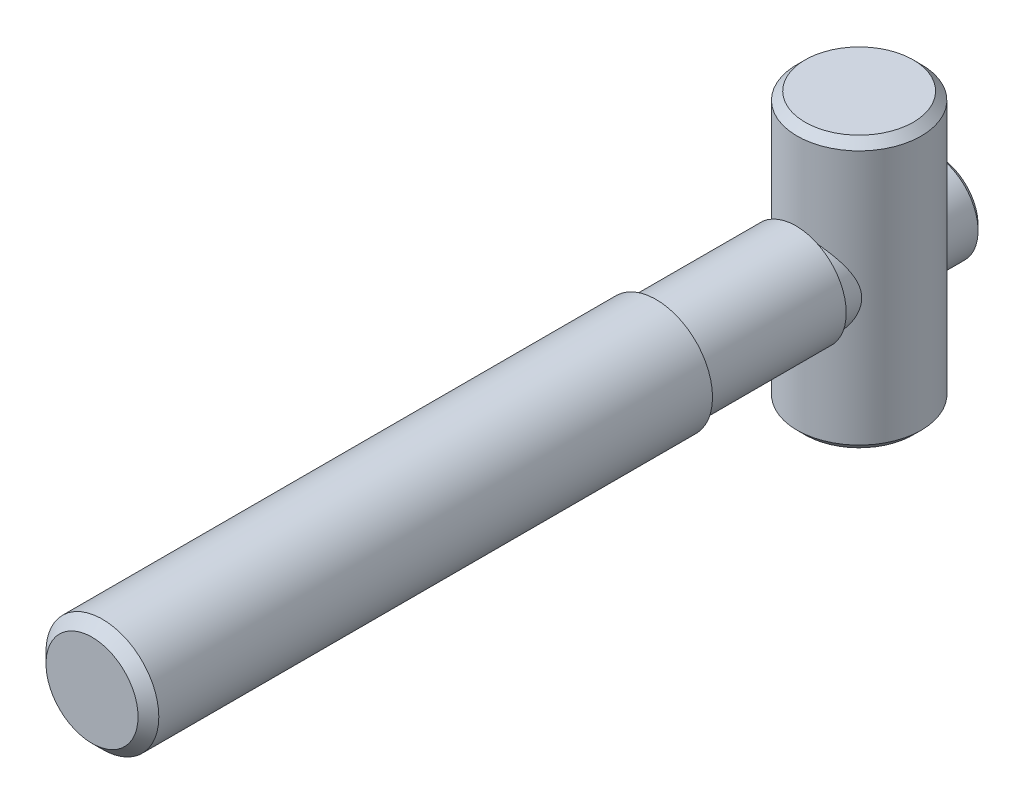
ISO-10303-21;
HEADER;
FILE_DESCRIPTION(('STEP AP214'),'2;1');
FILE_NAME('part.step','',(''),(''),'','','');
FILE_SCHEMA(('AUTOMOTIVE_DESIGN { 1 0 10303 214 1 1 1 1 }'));
ENDSEC;
DATA;
#1=APPLICATION_CONTEXT('core data for automotive mechanical design processes');
#2=APPLICATION_PROTOCOL_DEFINITION('international standard','automotive_design',2000,#1);
#3=PRODUCT_CONTEXT('',#1,'mechanical');
#4=PRODUCT('Part','Part','',(#3));
#5=PRODUCT_RELATED_PRODUCT_CATEGORY('part','',(#4));
#6=PRODUCT_DEFINITION_FORMATION('','',#4);
#7=PRODUCT_DEFINITION_CONTEXT('part definition',#1,'design');
#8=PRODUCT_DEFINITION('design','',#6,#7);
#9=PRODUCT_DEFINITION_SHAPE('','',#8);
#10=(LENGTH_UNIT() NAMED_UNIT(*) SI_UNIT(.MILLI.,.METRE.));
#11=(NAMED_UNIT(*) PLANE_ANGLE_UNIT() SI_UNIT($,.RADIAN.));
#12=(NAMED_UNIT(*) SI_UNIT($,.STERADIAN.) SOLID_ANGLE_UNIT());
#13=UNCERTAINTY_MEASURE_WITH_UNIT(LENGTH_MEASURE(1.E-05),#10,'distance_accuracy_value','');
#14=(GEOMETRIC_REPRESENTATION_CONTEXT(3) GLOBAL_UNCERTAINTY_ASSIGNED_CONTEXT((#13)) GLOBAL_UNIT_ASSIGNED_CONTEXT((#10,
#11,#12)) REPRESENTATION_CONTEXT('',''));
#15=CARTESIAN_POINT('',(0.,0.,0.));
#16=DIRECTION('',(0.,0.,1.));
#17=DIRECTION('',(1.,0.,0.));
#18=AXIS2_PLACEMENT_3D('',#15,#16,#17);
#19=CARTESIAN_POINT('',(0.,-12.,-18.3));
#20=DIRECTION('',(0.,-1.,0.));
#21=DIRECTION('',(-1.,0.,0.));
#22=AXIS2_PLACEMENT_3D('',#19,#20,#21);
#23=PLANE('',#22);
#24=CARTESIAN_POINT('',(0.,-12.,-18.3));
#25=DIRECTION('',(0.,-1.,0.));
#26=DIRECTION('',(-1.,0.,0.));
#27=AXIS2_PLACEMENT_3D('',#24,#25,#26);
#28=CIRCLE('',#27,4.79289321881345);
#29=CARTESIAN_POINT('',(-4.79289321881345,-12.,-18.3));
#30=VERTEX_POINT('',#29);
#31=EDGE_CURVE('E145',#30,#30,#28,.T.);
#32=ORIENTED_EDGE('',*,*,#31,.T.);
#33=EDGE_LOOP('',(#32));
#34=FACE_BOUND('',#33,.T.);
#35=ADVANCED_FACE('F14',(#34),#23,.T.);
#36=CARTESIAN_POINT('',(0.,12.,-18.3));
#37=DIRECTION('',(0.,1.,0.));
#38=DIRECTION('',(1.,0.,0.));
#39=AXIS2_PLACEMENT_3D('',#36,#37,#38);
#40=PLANE('',#39);
#41=CARTESIAN_POINT('',(0.,12.,-18.3));
#42=DIRECTION('',(0.,1.,0.));
#43=DIRECTION('',(1.,0.,0.));
#44=AXIS2_PLACEMENT_3D('',#41,#42,#43);
#45=CIRCLE('',#44,4.79289321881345);
#46=CARTESIAN_POINT('',(4.79289321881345,12.,-18.3));
#47=VERTEX_POINT('',#46);
#48=EDGE_CURVE('E9',#47,#47,#45,.T.);
#49=ORIENTED_EDGE('',*,*,#48,.T.);
#50=EDGE_LOOP('',(#49));
#51=FACE_BOUND('',#50,.T.);
#52=ADVANCED_FACE('F181',(#51),#40,.T.);
#53=CARTESIAN_POINT('',(0.,-12.,-18.3));
#54=DIRECTION('',(0.,1.,0.));
#55=DIRECTION('',(1.,0.,0.));
#56=AXIS2_PLACEMENT_3D('',#53,#54,#55);
#57=CONICAL_SURFACE('',#56,4.79289321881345,0.785398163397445);
#58=CARTESIAN_POINT('',(0.,-11.2928932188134,-18.3));
#59=DIRECTION('',(0.,-1.,0.));
#60=DIRECTION('',(-1.,0.,0.));
#61=AXIS2_PLACEMENT_3D('',#58,#59,#60);
#62=CIRCLE('',#61,5.5);
#63=CARTESIAN_POINT('',(-5.5,-11.2928932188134,-18.3));
#64=VERTEX_POINT('',#63);
#65=EDGE_CURVE('E23',#64,#64,#62,.F.);
#66=ORIENTED_EDGE('',*,*,#65,.F.);
#67=EDGE_LOOP('',(#66));
#68=FACE_BOUND('',#67,.T.);
#69=ORIENTED_EDGE('',*,*,#31,.F.);
#70=EDGE_LOOP('',(#69));
#71=FACE_BOUND('',#70,.T.);
#72=ADVANCED_FACE('F183',(#68,#71),#57,.T.);
#73=CARTESIAN_POINT('',(0.,12.,-18.3));
#74=DIRECTION('',(0.,-1.,0.));
#75=DIRECTION('',(-1.,0.,0.));
#76=AXIS2_PLACEMENT_3D('',#73,#74,#75);
#77=CONICAL_SURFACE('',#76,4.79289321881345,0.785398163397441);
#78=CARTESIAN_POINT('',(0.,11.2928932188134,-18.3));
#79=DIRECTION('',(0.,1.,0.));
#80=DIRECTION('',(1.,0.,0.));
#81=AXIS2_PLACEMENT_3D('',#78,#79,#80);
#82=CIRCLE('',#81,5.5);
#83=CARTESIAN_POINT('',(5.5,11.2928932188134,-18.3));
#84=VERTEX_POINT('',#83);
#85=EDGE_CURVE('E149',#84,#84,#82,.F.);
#86=ORIENTED_EDGE('',*,*,#85,.F.);
#87=EDGE_LOOP('',(#86));
#88=FACE_BOUND('',#87,.T.);
#89=ORIENTED_EDGE('',*,*,#48,.F.);
#90=EDGE_LOOP('',(#89));
#91=FACE_BOUND('',#90,.T.);
#92=ADVANCED_FACE('F174',(#88,#91),#77,.T.);
#93=CARTESIAN_POINT('',(0.,12.,-18.3));
#94=DIRECTION('',(0.,1.,0.));
#95=DIRECTION('',(1.,0.,0.));
#96=AXIS2_PLACEMENT_3D('',#93,#94,#95);
#97=CYLINDRICAL_SURFACE('',#96,5.5);
#98=DIRECTION('',(0.,1.,0.));
#99=VECTOR('',#98,1.);
#100=CARTESIAN_POINT('',(0.6,12.,-23.7671747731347));
#101=LINE('',#100,#99);
#102=CARTESIAN_POINT('',(0.6,-3.95474398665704,-23.7671747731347));
#103=VERTEX_POINT('',#102);
#104=CARTESIAN_POINT('',(0.6,3.95474398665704,-23.7671747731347));
#105=VERTEX_POINT('',#104);
#106=EDGE_CURVE('E81',#103,#105,#101,.T.);
#107=ORIENTED_EDGE('',*,*,#106,.F.);
#108=CARTESIAN_POINT('',(4.,0.,-22.0749172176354));
#109=CARTESIAN_POINT('',(3.99999971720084,0.094559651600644,-22.0749177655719));
#110=CARTESIAN_POINT('',(3.99663873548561,0.189122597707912,-22.078488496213));
#111=CARTESIAN_POINT('',(3.98328406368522,0.377297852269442,-22.0925637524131));
#112=CARTESIAN_POINT('',(3.97328671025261,0.470909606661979,-22.1030721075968));
#113=CARTESIAN_POINT('',(3.94687649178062,0.65648336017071,-22.1304732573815));
#114=CARTESIAN_POINT('',(3.93044906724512,0.748441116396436,-22.1473805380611));
#115=CARTESIAN_POINT('',(3.89152450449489,0.929870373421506,-22.1867470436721));
#116=CARTESIAN_POINT('',(3.86902376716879,1.01934036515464,-22.2092095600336));
#117=CARTESIAN_POINT('',(3.79365509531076,1.28093397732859,-22.2828450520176));
#118=CARTESIAN_POINT('',(3.73252985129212,1.44885844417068,-22.3407009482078));
#119=CARTESIAN_POINT('',(3.590688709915,1.77146295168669,-22.4672506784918));
#120=CARTESIAN_POINT('',(3.50997431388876,1.92614400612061,-22.5359436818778));
#121=CARTESIAN_POINT('',(3.31318173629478,2.25065582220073,-22.6922095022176));
#122=CARTESIAN_POINT('',(3.19328494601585,2.41764951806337,-22.7808675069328));
#123=CARTESIAN_POINT('',(2.92908108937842,2.73178094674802,-22.9578760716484));
#124=CARTESIAN_POINT('',(2.78474090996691,2.87889125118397,-23.0462260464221));
#125=CARTESIAN_POINT('',(2.5362822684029,3.09553636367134,-23.1814353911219));
#126=CARTESIAN_POINT('',(2.43963284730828,3.17231415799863,-23.2305740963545));
#127=CARTESIAN_POINT('',(2.23844845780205,3.31733570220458,-23.3251054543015));
#128=CARTESIAN_POINT('',(2.13391712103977,3.38558334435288,-23.3704998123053));
#129=CARTESIAN_POINT('',(1.91752007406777,3.51266692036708,-23.4562228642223));
#130=CARTESIAN_POINT('',(1.80566515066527,3.57151627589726,-23.49655876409));
#131=CARTESIAN_POINT('',(1.57523382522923,3.67896799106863,-23.5709873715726));
#132=CARTESIAN_POINT('',(1.45666071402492,3.72757531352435,-23.6050831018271));
#133=CARTESIAN_POINT('',(1.16188171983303,3.83193503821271,-23.678830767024));
#134=CARTESIAN_POINT('',(0.982606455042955,3.88193864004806,-23.7146815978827));
#135=CARTESIAN_POINT('',(0.616370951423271,3.95663720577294,-23.7684829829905));
#136=CARTESIAN_POINT('',(0.429417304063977,3.98135342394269,-23.7864485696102));
#137=CARTESIAN_POINT('',(0.052567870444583,4.00411402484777,-23.8029868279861));
#138=CARTESIAN_POINT('',(-0.137333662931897,4.00209732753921,-23.8015150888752));
#139=CARTESIAN_POINT('',(-0.51380986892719,3.97135939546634,-23.7791958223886));
#140=CARTESIAN_POINT('',(-0.700383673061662,3.94263129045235,-23.7583433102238));
#141=CARTESIAN_POINT('',(-1.05962164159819,3.86136821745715,-23.699944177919));
#142=CARTESIAN_POINT('',(-1.23253206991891,3.80954610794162,-23.6628980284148));
#143=CARTESIAN_POINT('',(-1.56671343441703,3.68473335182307,-23.5749694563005));
#144=CARTESIAN_POINT('',(-1.72798199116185,3.61173839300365,-23.5240842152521));
#145=CARTESIAN_POINT('',(-2.05370310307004,3.43803005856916,-23.4054456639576));
#146=CARTESIAN_POINT('',(-2.2165364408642,3.33514439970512,-23.3364494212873));
#147=CARTESIAN_POINT('',(-2.52348319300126,3.10940476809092,-23.189889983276));
#148=CARTESIAN_POINT('',(-2.66757825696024,2.98653148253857,-23.1123185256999));
#149=CARTESIAN_POINT('',(-2.96150593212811,2.69807007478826,-22.9383041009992));
#150=CARTESIAN_POINT('',(-3.10726104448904,2.52879913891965,-22.8410685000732));
#151=CARTESIAN_POINT('',(-3.36953999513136,2.16705523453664,-22.6499971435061));
#152=CARTESIAN_POINT('',(-3.48605965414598,1.97457895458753,-22.556161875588));
#153=CARTESIAN_POINT('',(-3.66526169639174,1.61165125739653,-22.402032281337));
#154=CARTESIAN_POINT('',(-3.73414032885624,1.44549066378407,-22.3388789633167));
#155=CARTESIAN_POINT('',(-3.84985589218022,1.10068331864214,-22.2287430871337));
#156=CARTESIAN_POINT('',(-3.89674227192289,0.922065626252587,-22.1817243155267));
#157=CARTESIAN_POINT('',(-3.9599937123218,0.585461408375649,-22.1170906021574));
#158=CARTESIAN_POINT('',(-3.98009730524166,0.428880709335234,-22.0959235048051));
#159=CARTESIAN_POINT('',(-4.00152507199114,0.113064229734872,-22.0733369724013));
#160=CARTESIAN_POINT('',(-4.00286519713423,-0.0461691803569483,-22.0719007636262));
#161=CARTESIAN_POINT('',(-3.98669865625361,-0.362327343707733,-22.0889767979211));
#162=CARTESIAN_POINT('',(-3.96921589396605,-0.519254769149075,-22.1074637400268));
#163=CARTESIAN_POINT('',(-3.91666535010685,-0.82717652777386,-22.1614916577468));
#164=CARTESIAN_POINT('',(-3.88157034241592,-0.978161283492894,-22.1970590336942));
#165=CARTESIAN_POINT('',(-3.77812999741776,-1.33113055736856,-22.2978469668));
#166=CARTESIAN_POINT('',(-3.70207893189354,-1.52906623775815,-22.3692423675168));
#167=CARTESIAN_POINT('',(-3.52270580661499,-1.90640842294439,-22.5254840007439));
#168=CARTESIAN_POINT('',(-3.41932922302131,-2.08577687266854,-22.6103569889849));
#169=CARTESIAN_POINT('',(-3.18411833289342,-2.43025180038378,-22.7870574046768));
#170=CARTESIAN_POINT('',(-3.05152555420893,-2.59477148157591,-22.8790168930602));
#171=CARTESIAN_POINT('',(-2.76125147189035,-2.90173861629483,-23.059699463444));
#172=CARTESIAN_POINT('',(-2.6035911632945,-3.04420434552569,-23.1484251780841));
#173=CARTESIAN_POINT('',(-2.271539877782,-3.2987599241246,-23.3122631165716));
#174=CARTESIAN_POINT('',(-2.09818660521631,-3.41190835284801,-23.3878018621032));
#175=CARTESIAN_POINT('',(-1.82330793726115,-3.56180731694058,-23.4899086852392));
#176=CARTESIAN_POINT('',(-1.72916099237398,-3.6084863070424,-23.5220894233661));
#177=CARTESIAN_POINT('',(-1.53632285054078,-3.69470582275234,-23.5820343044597));
#178=CARTESIAN_POINT('',(-1.43763386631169,-3.73424977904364,-23.6098005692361));
#179=CARTESIAN_POINT('',(-1.23534308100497,-3.80598862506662,-23.6604944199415));
#180=CARTESIAN_POINT('',(-1.13170490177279,-3.83811376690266,-23.683375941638));
#181=CARTESIAN_POINT('',(-0.921160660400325,-3.89401032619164,-23.7233693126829));
#182=CARTESIAN_POINT('',(-0.81425636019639,-3.9177861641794,-23.7404842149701));
#183=CARTESIAN_POINT('',(-0.598125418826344,-3.95655048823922,-23.7684652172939));
#184=CARTESIAN_POINT('',(-0.488900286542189,-3.9715445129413,-23.7793352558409));
#185=CARTESIAN_POINT('',(-0.269138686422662,-3.9924605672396,-23.7945144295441));
#186=CARTESIAN_POINT('',(-0.15860243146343,-3.99838404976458,-23.7988246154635));
#187=CARTESIAN_POINT('',(0.0467313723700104,-4.00084937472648,-23.8006178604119));
#188=CARTESIAN_POINT('',(0.141509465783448,-3.99861635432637,-23.7989924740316));
#189=CARTESIAN_POINT('',(0.330490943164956,-3.98744748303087,-23.7908762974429));
#190=CARTESIAN_POINT('',(0.424694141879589,-3.97850957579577,-23.7843840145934));
#191=CARTESIAN_POINT('',(0.611759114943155,-3.95406659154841,-23.7666782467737));
#192=CARTESIAN_POINT('',(0.704621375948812,-3.93856396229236,-23.7554665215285));
#193=CARTESIAN_POINT('',(0.88841574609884,-3.90122128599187,-23.7285691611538));
#194=CARTESIAN_POINT('',(0.979347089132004,-3.87937877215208,-23.7128817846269));
#195=CARTESIAN_POINT('',(1.24445933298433,-3.80583624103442,-23.6603363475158));
#196=CARTESIAN_POINT('',(1.41518501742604,-3.74554675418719,-23.6175701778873));
#197=CARTESIAN_POINT('',(1.74369677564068,-3.60438289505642,-23.5191022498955));
#198=CARTESIAN_POINT('',(1.90148075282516,-3.5235051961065,-23.4633984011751));
#199=CARTESIAN_POINT('',(2.22228203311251,-3.33179335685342,-23.3343972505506));
#200=CARTESIAN_POINT('',(2.38322541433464,-3.21841054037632,-23.2597469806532));
#201=CARTESIAN_POINT('',(2.68497920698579,-2.97136345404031,-23.103106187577));
#202=CARTESIAN_POINT('',(2.82576198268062,-2.8376718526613,-23.0211058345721));
#203=CARTESIAN_POINT('',(3.03332548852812,-2.61000808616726,-22.8888332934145));
#204=CARTESIAN_POINT('',(3.10699576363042,-2.5218601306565,-22.839152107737));
#205=CARTESIAN_POINT('',(3.24665706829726,-2.3393224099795,-22.7403298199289));
#206=CARTESIAN_POINT('',(3.31264615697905,-2.24493107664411,-22.69118885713));
#207=CARTESIAN_POINT('',(3.43660180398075,-2.0501419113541,-22.5948719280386));
#208=CARTESIAN_POINT('',(3.49457298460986,-1.94974758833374,-22.5476948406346));
#209=CARTESIAN_POINT('',(3.6021255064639,-1.74306577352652,-22.4568795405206));
#210=CARTESIAN_POINT('',(3.6517073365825,-1.63677862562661,-22.4132411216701));
#211=CARTESIAN_POINT('',(3.76078752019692,-1.37275858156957,-22.3142162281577));
#212=CARTESIAN_POINT('',(3.81580236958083,-1.21205137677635,-22.2615166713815));
#213=CARTESIAN_POINT('',(3.88309107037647,-0.963817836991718,-22.1952018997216));
#214=CARTESIAN_POINT('',(3.90296834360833,-0.879972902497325,-22.1752342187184));
#215=CARTESIAN_POINT('',(3.93739985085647,-0.710192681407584,-22.1402454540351));
#216=CARTESIAN_POINT('',(3.95195647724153,-0.62425835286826,-22.1252221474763));
#217=CARTESIAN_POINT('',(3.97571410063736,-0.449073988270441,-22.1005263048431));
#218=CARTESIAN_POINT('',(3.98480070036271,-0.359792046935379,-22.0909682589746));
#219=CARTESIAN_POINT('',(3.99694447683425,-0.180341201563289,-22.0781627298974));
#220=CARTESIAN_POINT('',(4.00000026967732,-0.0901720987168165,-22.0749166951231));
#221=CARTESIAN_POINT('',(4.,0.,-22.0749172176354));
#222=B_SPLINE_CURVE_WITH_KNOTS('',3,(#108,#109,#110,#111,#112,#113,#114,#115,#116,#117,#118,
#119,#120,#121,#122,#123,#124,#125,#126,#127,#128,#129,#130,#131,#132,#133,#134,#135,#136,#137,
#138,#139,#140,#141,#142,#143,#144,#145,#146,#147,#148,#149,#150,#151,#152,#153,#154,#155,#156,
#157,#158,#159,#160,#161,#162,#163,#164,#165,#166,#167,#168,#169,#170,#171,#172,#173,#174,#175,
#176,#177,#178,#179,#180,#181,#182,#183,#184,#185,#186,#187,#188,#189,#190,#191,#192,#193,#194,
#195,#196,#197,#198,#199,#200,#201,#202,#203,#204,#205,#206,#207,#208,#209,#210,#211,#212,#213,
#214,#215,#216,#217,#218,#219,#220,#221),.UNSPECIFIED.,.T.,.F.,(4,2,2,2,2,2,2,2,2,2,2,2,2,2,2,2,
2,2,2,2,2,2,2,2,2,2,2,2,2,2,2,2,2,2,2,2,2,2,2,2,2,2,2,2,2,2,2,2,2,2,2,2,2,2,2,2,4),(0.,
0.283560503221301,0.567277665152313,0.851640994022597,1.13617321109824,1.69729774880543,
2.25837929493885,2.92774006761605,3.59801497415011,3.99610080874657,4.39400433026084,
4.79133442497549,5.18847154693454,5.75445889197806,6.31997012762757,6.88677367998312,
7.45372305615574,8.00426875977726,8.5549266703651,9.16646484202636,9.77859745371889,
10.5066073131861,11.2347211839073,11.8047550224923,12.3735009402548,12.8491941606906,
13.3244829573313,13.7991688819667,14.2745908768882,14.94214771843,15.6110467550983,
16.2999460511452,16.9882713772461,17.6463931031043,17.9757519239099,18.3049519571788,
18.6371312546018,18.9691344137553,19.3009279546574,19.6326683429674,19.9167672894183,
20.2009534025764,20.4850336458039,20.7692245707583,21.3249022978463,21.8806698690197,
22.5100347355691,23.1402542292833,23.5154020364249,23.8906444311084,24.2656695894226,
24.6406728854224,25.1720162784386,25.4371121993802,25.7020887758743,25.9724300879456,
26.24283342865),.UNSPECIFIED.);
#223=EDGE_CURVE('E76',#103,#105,#222,.T.);
#224=ORIENTED_EDGE('',*,*,#223,.T.);
#225=EDGE_LOOP('',(#107,#224));
#226=FACE_BOUND('',#225,.T.);
#227=ORIENTED_EDGE('',*,*,#85,.T.);
#228=EDGE_LOOP('',(#227));
#229=FACE_BOUND('',#228,.T.);
#230=ORIENTED_EDGE('',*,*,#65,.T.);
#231=EDGE_LOOP('',(#230));
#232=FACE_BOUND('',#231,.T.);
#233=CARTESIAN_POINT('',(4.,0.,-14.5250827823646));
#234=CARTESIAN_POINT('',(3.99999971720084,-0.0945596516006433,-14.5250822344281));
#235=CARTESIAN_POINT('',(3.99663873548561,-0.189122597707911,-14.521511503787));
#236=CARTESIAN_POINT('',(3.98328406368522,-0.37729785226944,-14.5074362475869));
#237=CARTESIAN_POINT('',(3.97328671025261,-0.470909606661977,-14.4969278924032));
#238=CARTESIAN_POINT('',(3.94687649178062,-0.65648336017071,-14.4695267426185));
#239=CARTESIAN_POINT('',(3.93044906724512,-0.748441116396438,-14.4526194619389));
#240=CARTESIAN_POINT('',(3.89152450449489,-0.929870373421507,-14.4132529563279));
#241=CARTESIAN_POINT('',(3.86902376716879,-1.01934036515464,-14.3907904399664));
#242=CARTESIAN_POINT('',(3.79365509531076,-1.28093397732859,-14.3171549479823));
#243=CARTESIAN_POINT('',(3.73252985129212,-1.44885844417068,-14.2592990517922));
#244=CARTESIAN_POINT('',(3.590688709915,-1.7714629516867,-14.1327493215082));
#245=CARTESIAN_POINT('',(3.50997431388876,-1.92614400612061,-14.0640563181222));
#246=CARTESIAN_POINT('',(3.31318173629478,-2.25065582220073,-13.9077904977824));
#247=CARTESIAN_POINT('',(3.19328494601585,-2.41764951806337,-13.8191324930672));
#248=CARTESIAN_POINT('',(2.92908108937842,-2.73178094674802,-13.6421239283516));
#249=CARTESIAN_POINT('',(2.78474090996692,-2.87889125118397,-13.5537739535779));
#250=CARTESIAN_POINT('',(2.53628226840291,-3.09553636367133,-13.4185646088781));
#251=CARTESIAN_POINT('',(2.43963284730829,-3.17231415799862,-13.3694259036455));
#252=CARTESIAN_POINT('',(2.23844845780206,-3.31733570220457,-13.2748945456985));
#253=CARTESIAN_POINT('',(2.13391712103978,-3.38558334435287,-13.2295001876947));
#254=CARTESIAN_POINT('',(1.91752007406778,-3.51266692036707,-13.1437771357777));
#255=CARTESIAN_POINT('',(1.80566515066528,-3.57151627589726,-13.10344123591));
#256=CARTESIAN_POINT('',(1.57523382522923,-3.67896799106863,-13.0290126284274));
#257=CARTESIAN_POINT('',(1.45666071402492,-3.72757531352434,-12.9949168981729));
#258=CARTESIAN_POINT('',(1.16188171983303,-3.83193503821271,-12.921169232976));
#259=CARTESIAN_POINT('',(0.982606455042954,-3.88193864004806,-12.8853184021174));
#260=CARTESIAN_POINT('',(0.616370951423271,-3.95663720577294,-12.8315170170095));
#261=CARTESIAN_POINT('',(0.429417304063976,-3.98135342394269,-12.8135514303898));
#262=CARTESIAN_POINT('',(0.0525678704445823,-4.00411402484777,-12.7970131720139));
#263=CARTESIAN_POINT('',(-0.137333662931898,-4.00209732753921,-12.7984849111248));
#264=CARTESIAN_POINT('',(-0.51380986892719,-3.97135939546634,-12.8208041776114));
#265=CARTESIAN_POINT('',(-0.700383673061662,-3.94263129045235,-12.8416566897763));
#266=CARTESIAN_POINT('',(-1.05962164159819,-3.86136821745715,-12.900055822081));
#267=CARTESIAN_POINT('',(-1.23253206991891,-3.80954610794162,-12.9371019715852));
#268=CARTESIAN_POINT('',(-1.56671343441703,-3.68473335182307,-13.0250305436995));
#269=CARTESIAN_POINT('',(-1.72798199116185,-3.61173839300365,-13.0759157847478));
#270=CARTESIAN_POINT('',(-2.05370310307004,-3.43803005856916,-13.1945543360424));
#271=CARTESIAN_POINT('',(-2.2165364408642,-3.33514439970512,-13.2635505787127));
#272=CARTESIAN_POINT('',(-2.52348319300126,-3.10940476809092,-13.410110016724));
#273=CARTESIAN_POINT('',(-2.66757825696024,-2.98653148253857,-13.4876814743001));
#274=CARTESIAN_POINT('',(-2.96150593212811,-2.69807007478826,-13.6616958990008));
#275=CARTESIAN_POINT('',(-3.10726104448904,-2.52879913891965,-13.7589314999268));
#276=CARTESIAN_POINT('',(-3.36953999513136,-2.16705523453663,-13.9500028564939));
#277=CARTESIAN_POINT('',(-3.48605965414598,-1.97457895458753,-14.043838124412));
#278=CARTESIAN_POINT('',(-3.66526169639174,-1.61165125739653,-14.197967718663));
#279=CARTESIAN_POINT('',(-3.73414032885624,-1.44549066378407,-14.2611210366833));
#280=CARTESIAN_POINT('',(-3.84985589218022,-1.10068331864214,-14.3712569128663));
#281=CARTESIAN_POINT('',(-3.8967422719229,-0.922065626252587,-14.4182756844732));
#282=CARTESIAN_POINT('',(-3.95999371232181,-0.585461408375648,-14.4829093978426));
#283=CARTESIAN_POINT('',(-3.98009730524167,-0.428880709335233,-14.5040764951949));
#284=CARTESIAN_POINT('',(-4.00152507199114,-0.113064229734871,-14.5266630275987));
#285=CARTESIAN_POINT('',(-4.00286519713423,0.0461691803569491,-14.5280992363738));
#286=CARTESIAN_POINT('',(-3.98669865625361,0.362327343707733,-14.5110232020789));
#287=CARTESIAN_POINT('',(-3.96921589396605,0.519254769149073,-14.4925362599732));
#288=CARTESIAN_POINT('',(-3.91666535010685,0.827176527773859,-14.4385083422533));
#289=CARTESIAN_POINT('',(-3.88157034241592,0.978161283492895,-14.4029409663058));
#290=CARTESIAN_POINT('',(-3.77812999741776,1.33113055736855,-14.3021530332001));
#291=CARTESIAN_POINT('',(-3.70207893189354,1.52906623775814,-14.2307576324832));
#292=CARTESIAN_POINT('',(-3.522705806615,1.90640842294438,-14.0745159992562));
#293=CARTESIAN_POINT('',(-3.41932922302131,2.08577687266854,-13.9896430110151));
#294=CARTESIAN_POINT('',(-3.18411833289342,2.43025180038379,-13.8129425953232));
#295=CARTESIAN_POINT('',(-3.05152555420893,2.59477148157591,-13.7209831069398));
#296=CARTESIAN_POINT('',(-2.76125147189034,2.90173861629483,-13.540300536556));
#297=CARTESIAN_POINT('',(-2.6035911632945,3.04420434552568,-13.4515748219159));
#298=CARTESIAN_POINT('',(-2.271539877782,3.2987599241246,-13.2877368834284));
#299=CARTESIAN_POINT('',(-2.09818660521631,3.41190835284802,-13.2121981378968));
#300=CARTESIAN_POINT('',(-1.82330793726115,3.56180731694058,-13.1100913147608));
#301=CARTESIAN_POINT('',(-1.72916099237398,3.6084863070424,-13.0779105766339));
#302=CARTESIAN_POINT('',(-1.53632285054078,3.69470582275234,-13.0179656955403));
#303=CARTESIAN_POINT('',(-1.43763386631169,3.73424977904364,-12.990199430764));
#304=CARTESIAN_POINT('',(-1.23534308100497,3.80598862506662,-12.9395055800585));
#305=CARTESIAN_POINT('',(-1.13170490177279,3.83811376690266,-12.916624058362));
#306=CARTESIAN_POINT('',(-0.921160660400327,3.89401032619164,-12.8766306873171));
#307=CARTESIAN_POINT('',(-0.814256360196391,3.9177861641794,-12.8595157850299));
#308=CARTESIAN_POINT('',(-0.598125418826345,3.95655048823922,-12.8315347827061));
#309=CARTESIAN_POINT('',(-0.488900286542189,3.9715445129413,-12.8206647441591));
#310=CARTESIAN_POINT('',(-0.269138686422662,3.9924605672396,-12.8054855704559));
#311=CARTESIAN_POINT('',(-0.158602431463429,3.99838404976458,-12.8011753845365));
#312=CARTESIAN_POINT('',(0.046731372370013,4.00084937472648,-12.7993821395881));
#313=CARTESIAN_POINT('',(0.141509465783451,3.99861635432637,-12.8010075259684));
#314=CARTESIAN_POINT('',(0.330490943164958,3.98744748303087,-12.8091237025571));
#315=CARTESIAN_POINT('',(0.424694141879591,3.97850957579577,-12.8156159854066));
#316=CARTESIAN_POINT('',(0.611759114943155,3.95406659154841,-12.8333217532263));
#317=CARTESIAN_POINT('',(0.704621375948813,3.93856396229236,-12.8445334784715));
#318=CARTESIAN_POINT('',(0.88841574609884,3.90122128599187,-12.8714308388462));
#319=CARTESIAN_POINT('',(0.979347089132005,3.87937877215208,-12.8871182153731));
#320=CARTESIAN_POINT('',(1.24445933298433,3.80583624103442,-12.9396636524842));
#321=CARTESIAN_POINT('',(1.41518501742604,3.74554675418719,-12.9824298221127));
#322=CARTESIAN_POINT('',(1.74369677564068,3.60438289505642,-13.0808977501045));
#323=CARTESIAN_POINT('',(1.90148075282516,3.5235051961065,-13.1366015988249));
#324=CARTESIAN_POINT('',(2.22228203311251,3.33179335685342,-13.2656027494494));
#325=CARTESIAN_POINT('',(2.38322541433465,3.21841054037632,-13.3402530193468));
#326=CARTESIAN_POINT('',(2.68497920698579,2.97136345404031,-13.496893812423));
#327=CARTESIAN_POINT('',(2.82576198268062,2.8376718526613,-13.5788941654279));
#328=CARTESIAN_POINT('',(3.03332548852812,2.61000808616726,-13.7111667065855));
#329=CARTESIAN_POINT('',(3.10699576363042,2.5218601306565,-13.760847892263));
#330=CARTESIAN_POINT('',(3.24665706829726,2.33932240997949,-13.8596701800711));
#331=CARTESIAN_POINT('',(3.31264615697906,2.24493107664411,-13.9088111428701));
#332=CARTESIAN_POINT('',(3.43660180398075,2.05014191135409,-14.0051280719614));
#333=CARTESIAN_POINT('',(3.49457298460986,1.94974758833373,-14.0523051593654));
#334=CARTESIAN_POINT('',(3.60212550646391,1.74306577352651,-14.1431204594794));
#335=CARTESIAN_POINT('',(3.65170733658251,1.6367786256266,-14.18675887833));
#336=CARTESIAN_POINT('',(3.76078752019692,1.37275858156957,-14.2857837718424));
#337=CARTESIAN_POINT('',(3.81580236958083,1.21205137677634,-14.3384833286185));
#338=CARTESIAN_POINT('',(3.88309107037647,0.963817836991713,-14.4047981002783));
#339=CARTESIAN_POINT('',(3.90296834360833,0.879972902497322,-14.4247657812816));
#340=CARTESIAN_POINT('',(3.93739985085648,0.71019268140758,-14.4597545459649));
#341=CARTESIAN_POINT('',(3.95195647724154,0.624258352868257,-14.4747778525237));
#342=CARTESIAN_POINT('',(3.97571410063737,0.449073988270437,-14.4994736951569));
#343=CARTESIAN_POINT('',(3.98480070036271,0.359792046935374,-14.5090317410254));
#344=CARTESIAN_POINT('',(3.99694447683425,0.180341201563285,-14.5218372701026));
#345=CARTESIAN_POINT('',(4.00000026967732,0.0901720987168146,-14.525083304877));
#346=CARTESIAN_POINT('',(4.,0.,-14.5250827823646));
#347=B_SPLINE_CURVE_WITH_KNOTS('',3,(#233,#234,#235,#236,#237,#238,#239,#240,#241,#242,#243,
#244,#245,#246,#247,#248,#249,#250,#251,#252,#253,#254,#255,#256,#257,#258,#259,#260,#261,#262,
#263,#264,#265,#266,#267,#268,#269,#270,#271,#272,#273,#274,#275,#276,#277,#278,#279,#280,#281,
#282,#283,#284,#285,#286,#287,#288,#289,#290,#291,#292,#293,#294,#295,#296,#297,#298,#299,#300,
#301,#302,#303,#304,#305,#306,#307,#308,#309,#310,#311,#312,#313,#314,#315,#316,#317,#318,#319,
#320,#321,#322,#323,#324,#325,#326,#327,#328,#329,#330,#331,#332,#333,#334,#335,#336,#337,#338,
#339,#340,#341,#342,#343,#344,#345,#346),.UNSPECIFIED.,.T.,.F.,(4,2,2,2,2,2,2,2,2,2,2,2,2,2,2,2,
2,2,2,2,2,2,2,2,2,2,2,2,2,2,2,2,2,2,2,2,2,2,2,2,2,2,2,2,2,2,2,2,2,2,2,2,2,2,2,2,4),(0.,
0.2835605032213,0.567277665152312,0.851640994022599,1.13617321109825,1.69729774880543,
2.25837929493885,2.92774006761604,3.59801497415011,3.99610080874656,4.39400433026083,
4.79133442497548,5.18847154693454,5.75445889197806,6.31997012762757,6.88677367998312,
7.45372305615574,8.00426875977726,8.5549266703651,9.16646484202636,9.77859745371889,
10.5066073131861,11.2347211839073,11.8047550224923,12.3735009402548,12.8491941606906,
13.3244829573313,13.7991688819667,14.2745908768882,14.94214771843,15.6110467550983,
16.2999460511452,16.9882713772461,17.6463931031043,17.9757519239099,18.3049519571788,
18.6371312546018,18.9691344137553,19.3009279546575,19.6326683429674,19.9167672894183,
20.2009534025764,20.4850336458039,20.7692245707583,21.3249022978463,21.8806698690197,
22.5100347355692,23.1402542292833,23.5154020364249,23.8906444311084,24.2656695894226,
24.6406728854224,25.1720162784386,25.4371121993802,25.7020887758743,25.9724300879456,
26.24283342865),.UNSPECIFIED.);
#348=CARTESIAN_POINT('',(4.,0.,-14.5250827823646));
#349=VERTEX_POINT('',#348);
#350=EDGE_CURVE('E164',#349,#349,#347,.T.);
#351=ORIENTED_EDGE('',*,*,#350,.T.);
#352=EDGE_LOOP('',(#351));
#353=FACE_BOUND('',#352,.T.);
#354=CARTESIAN_POINT('',(-0.6,3.95474398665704,-23.7671747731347));
#355=VERTEX_POINT('',#354);
#356=CARTESIAN_POINT('',(-0.6,-3.95474398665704,-23.7671747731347));
#357=VERTEX_POINT('',#356);
#358=EDGE_CURVE('E66',#355,#357,#222,.T.);
#359=ORIENTED_EDGE('',*,*,#358,.T.);
#360=DIRECTION('',(0.,1.,0.));
#361=VECTOR('',#360,1.);
#362=CARTESIAN_POINT('',(-0.6,12.,-23.7671747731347));
#363=LINE('',#362,#361);
#364=EDGE_CURVE('E77',#357,#355,#363,.T.);
#365=ORIENTED_EDGE('',*,*,#364,.T.);
#366=EDGE_LOOP('',(#359,#365));
#367=FACE_BOUND('',#366,.T.);
#368=ADVANCED_FACE('F79',(#226,#229,#232,#353,#367),#97,.T.);
#369=CARTESIAN_POINT('',(0.,0.,24.7));
#370=DIRECTION('',(0.,0.,1.));
#371=DIRECTION('',(1.,0.,0.));
#372=AXIS2_PLACEMENT_3D('',#369,#370,#371);
#373=CYLINDRICAL_SURFACE('',#372,5.);
#374=CARTESIAN_POINT('',(0.,0.,-0.300000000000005));
#375=DIRECTION('',(0.,0.,1.));
#376=DIRECTION('',(1.,0.,0.));
#377=AXIS2_PLACEMENT_3D('',#374,#375,#376);
#378=CIRCLE('',#377,5.);
#379=CARTESIAN_POINT('',(5.,0.,-0.300000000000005));
#380=VERTEX_POINT('',#379);
#381=EDGE_CURVE('E105',#380,#380,#378,.T.);
#382=ORIENTED_EDGE('',*,*,#381,.T.);
#383=EDGE_LOOP('',(#382));
#384=FACE_BOUND('',#383,.T.);
#385=CARTESIAN_POINT('',(0.,0.,48.78));
#386=DIRECTION('',(0.,0.,1.));
#387=DIRECTION('',(1.,0.,0.));
#388=AXIS2_PLACEMENT_3D('',#385,#386,#387);
#389=CIRCLE('',#388,5.);
#390=CARTESIAN_POINT('',(5.,0.,48.78));
#391=VERTEX_POINT('',#390);
#392=EDGE_CURVE('E215',#391,#391,#389,.T.);
#393=ORIENTED_EDGE('',*,*,#392,.F.);
#394=EDGE_LOOP('',(#393));
#395=FACE_BOUND('',#394,.T.);
#396=ADVANCED_FACE('F134',(#384,#395),#373,.T.);
#397=CARTESIAN_POINT('',(0.,0.,-0.300000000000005));
#398=DIRECTION('',(0.,0.,1.));
#399=DIRECTION('',(1.,0.,0.));
#400=AXIS2_PLACEMENT_3D('',#397,#398,#399);
#401=PLANE('',#400);
#402=ORIENTED_EDGE('',*,*,#381,.F.);
#403=EDGE_LOOP('',(#402));
#404=FACE_BOUND('',#403,.T.);
#405=CARTESIAN_POINT('',(0.,0.,-0.300000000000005));
#406=DIRECTION('',(0.,0.,1.));
#407=DIRECTION('',(1.,0.,0.));
#408=AXIS2_PLACEMENT_3D('',#405,#406,#407);
#409=CIRCLE('',#408,4.45);
#410=CARTESIAN_POINT('',(4.45,0.,-0.300000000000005));
#411=VERTEX_POINT('',#410);
#412=EDGE_CURVE('E102',#411,#411,#409,.T.);
#413=ORIENTED_EDGE('',*,*,#412,.T.);
#414=EDGE_LOOP('',(#413));
#415=FACE_BOUND('',#414,.T.);
#416=ADVANCED_FACE('F275',(#404,#415),#401,.F.);
#417=CARTESIAN_POINT('',(0.,0.,-0.300000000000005));
#418=DIRECTION('',(0.,0.,1.));
#419=DIRECTION('',(1.,0.,0.));
#420=AXIS2_PLACEMENT_3D('',#417,#418,#419);
#421=CYLINDRICAL_SURFACE('',#420,4.45);
#422=ORIENTED_EDGE('',*,*,#412,.F.);
#423=EDGE_LOOP('',(#422));
#424=FACE_BOUND('',#423,.T.);
#425=CARTESIAN_POINT('',(0.,0.,-12.7));
#426=DIRECTION('',(0.,0.,-1.));
#427=DIRECTION('',(-1.,0.,0.));
#428=AXIS2_PLACEMENT_3D('',#425,#426,#427);
#429=CIRCLE('',#428,4.45);
#430=CARTESIAN_POINT('',(-4.45,0.,-12.7));
#431=VERTEX_POINT('',#430);
#432=EDGE_CURVE('E140',#431,#431,#429,.T.);
#433=ORIENTED_EDGE('',*,*,#432,.F.);
#434=EDGE_LOOP('',(#433));
#435=FACE_BOUND('',#434,.T.);
#436=ADVANCED_FACE('F284',(#424,#435),#421,.T.);
#437=CARTESIAN_POINT('',(0.,0.,-12.7));
#438=DIRECTION('',(0.,0.,-1.));
#439=DIRECTION('',(-1.,0.,0.));
#440=AXIS2_PLACEMENT_3D('',#437,#438,#439);
#441=PLANE('',#440);
#442=CARTESIAN_POINT('',(0.,0.,-12.7));
#443=DIRECTION('',(0.,0.,-1.));
#444=DIRECTION('',(-1.,0.,0.));
#445=AXIS2_PLACEMENT_3D('',#442,#443,#444);
#446=CIRCLE('',#445,4.);
#447=CARTESIAN_POINT('',(-4.,0.,-12.7));
#448=VERTEX_POINT('',#447);
#449=EDGE_CURVE('E18',#448,#448,#446,.T.);
#450=ORIENTED_EDGE('',*,*,#449,.F.);
#451=EDGE_LOOP('',(#450));
#452=FACE_BOUND('',#451,.T.);
#453=ORIENTED_EDGE('',*,*,#432,.T.);
#454=EDGE_LOOP('',(#453));
#455=FACE_BOUND('',#454,.T.);
#456=ADVANCED_FACE('F16',(#452,#455),#441,.T.);
#457=CARTESIAN_POINT('',(0.,0.,-12.8));
#458=DIRECTION('',(0.,0.,1.));
#459=DIRECTION('',(1.,0.,0.));
#460=AXIS2_PLACEMENT_3D('',#457,#458,#459);
#461=CYLINDRICAL_SURFACE('',#460,4.);
#462=ORIENTED_EDGE('',*,*,#449,.T.);
#463=EDGE_LOOP('',(#462));
#464=FACE_BOUND('',#463,.T.);
#465=ORIENTED_EDGE('',*,*,#350,.F.);
#466=EDGE_LOOP('',(#465));
#467=FACE_BOUND('',#466,.T.);
#468=ADVANCED_FACE('F198',(#464,#467),#461,.T.);
#469=CARTESIAN_POINT('',(0.,0.,-25.3));
#470=DIRECTION('',(0.,0.,1.));
#471=DIRECTION('',(1.,0.,0.));
#472=AXIS2_PLACEMENT_3D('',#469,#470,#471);
#473=PLANE('',#472);
#474=DIRECTION('',(0.,-1.,0.));
#475=VECTOR('',#474,1.);
#476=CARTESIAN_POINT('',(0.6,0.,-25.3));
#477=LINE('',#476,#475);
#478=CARTESIAN_POINT('',(0.6,3.48878202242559,-25.3));
#479=VERTEX_POINT('',#478);
#480=CARTESIAN_POINT('',(0.6,-3.48878202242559,-25.3));
#481=VERTEX_POINT('',#480);
#482=EDGE_CURVE('E119',#479,#481,#477,.T.);
#483=ORIENTED_EDGE('',*,*,#482,.F.);
#484=CARTESIAN_POINT('',(0.,0.,-25.3));
#485=DIRECTION('',(0.,0.,1.));
#486=DIRECTION('',(1.,0.,0.));
#487=AXIS2_PLACEMENT_3D('',#484,#485,#486);
#488=CIRCLE('',#487,3.54);
#489=EDGE_CURVE('E95',#481,#479,#488,.T.);
#490=ORIENTED_EDGE('',*,*,#489,.F.);
#491=EDGE_LOOP('',(#483,#490));
#492=FACE_BOUND('',#491,.T.);
#493=ADVANCED_FACE('F188',(#492),#473,.F.);
#494=CARTESIAN_POINT('',(0.,0.,-25.3));
#495=DIRECTION('',(0.,0.,1.));
#496=DIRECTION('',(1.,0.,0.));
#497=AXIS2_PLACEMENT_3D('',#494,#495,#496);
#498=CONICAL_SURFACE('',#497,3.54,0.785398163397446);
#499=CARTESIAN_POINT('',(0.6,3.9554519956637,-24.8393));
#500=CARTESIAN_POINT('',(0.6,3.83941046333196,-24.9540237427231));
#501=CARTESIAN_POINT('',(0.6,3.72331727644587,-25.0686953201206));
#502=CARTESIAN_POINT('',(0.6,3.49091447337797,-25.2979511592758));
#503=CARTESIAN_POINT('',(0.6,3.37460477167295,-25.4125353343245));
#504=CARTESIAN_POINT('',(0.6,3.14054409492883,-25.642725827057));
#505=CARTESIAN_POINT('',(0.6,3.02279099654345,-25.7583299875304));
#506=CARTESIAN_POINT('',(0.6,2.78706506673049,-25.9891808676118));
#507=CARTESIAN_POINT('',(0.6,2.66909239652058,-26.1044277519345));
#508=CARTESIAN_POINT('',(0.6,2.38769992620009,-26.3783597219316));
#509=CARTESIAN_POINT('',(0.6,2.2240974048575,-26.536857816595));
#510=CARTESIAN_POINT('',(0.6,1.97745696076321,-26.7736454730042));
#511=CARTESIAN_POINT('',(0.6,1.89495476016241,-26.8524926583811));
#512=CARTESIAN_POINT('',(0.6,1.72944434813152,-27.0096193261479));
#513=CARTESIAN_POINT('',(0.6,1.64643625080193,-27.0878989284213));
#514=CARTESIAN_POINT('',(0.6,1.48033289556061,-27.2429690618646));
#515=CARTESIAN_POINT('',(0.6,1.39724415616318,-27.319766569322));
#516=CARTESIAN_POINT('',(0.6,1.2297853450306,-27.4721053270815));
#517=CARTESIAN_POINT('',(0.6,1.14541426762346,-27.5476454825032));
#518=CARTESIAN_POINT('',(0.6,1.01743134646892,-27.6590099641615));
#519=CARTESIAN_POINT('',(0.6,0.974611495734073,-27.6957423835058));
#520=CARTESIAN_POINT('',(0.6,0.88825104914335,-27.7683476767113));
#521=CARTESIAN_POINT('',(0.6,0.844710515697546,-27.8042206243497));
#522=CARTESIAN_POINT('',(0.6,0.756681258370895,-27.8746657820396));
#523=CARTESIAN_POINT('',(0.6,0.712193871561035,-27.9092396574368));
#524=CARTESIAN_POINT('',(0.6,0.621791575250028,-27.9764590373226));
#525=CARTESIAN_POINT('',(0.6,0.575877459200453,-28.0091055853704));
#526=CARTESIAN_POINT('',(0.6,0.517059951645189,-28.0479937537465));
#527=CARTESIAN_POINT('',(0.6,0.505142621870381,-28.0557273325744));
#528=CARTESIAN_POINT('',(0.6,0.481156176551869,-28.0709583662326));
#529=CARTESIAN_POINT('',(0.6,0.469087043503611,-28.0784557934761));
#530=CARTESIAN_POINT('',(0.6,0.432629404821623,-28.1005451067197));
#531=CARTESIAN_POINT('',(0.6,0.407992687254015,-28.1147326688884));
#532=CARTESIAN_POINT('',(0.6,0.358127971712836,-28.1415606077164));
#533=CARTESIAN_POINT('',(0.6,0.332906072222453,-28.1542121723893));
#534=CARTESIAN_POINT('',(0.6,0.28159268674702,-28.1776006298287));
#535=CARTESIAN_POINT('',(0.6,0.255501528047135,-28.1883382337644));
#536=CARTESIAN_POINT('',(0.6,0.19385499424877,-28.2103112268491));
#537=CARTESIAN_POINT('',(0.6,0.157946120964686,-28.2206034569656));
#538=CARTESIAN_POINT('',(0.6,0.0849893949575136,-28.2350528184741));
#539=CARTESIAN_POINT('',(0.6,0.0479465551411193,-28.2392338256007));
#540=CARTESIAN_POINT('',(0.6,-0.0264554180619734,-28.2405737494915));
#541=CARTESIAN_POINT('',(0.6,-0.0638152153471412,-28.237698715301));
#542=CARTESIAN_POINT('',(0.6,-0.137530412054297,-28.2255268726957));
#543=CARTESIAN_POINT('',(0.6,-0.173882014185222,-28.2162085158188));
#544=CARTESIAN_POINT('',(0.6,-0.246261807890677,-28.1923675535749));
#545=CARTESIAN_POINT('',(0.6,-0.282227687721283,-28.1776642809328));
#546=CARTESIAN_POINT('',(0.6,-0.352560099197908,-28.1447807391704));
#547=CARTESIAN_POINT('',(0.6,-0.386923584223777,-28.1265941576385));
#548=CARTESIAN_POINT('',(0.6,-0.454569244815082,-28.0877625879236));
#549=CARTESIAN_POINT('',(0.6,-0.487840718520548,-28.0670992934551));
#550=CARTESIAN_POINT('',(0.6,-0.553299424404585,-28.024199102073));
#551=CARTESIAN_POINT('',(0.6,-0.585487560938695,-28.0019635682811));
#552=CARTESIAN_POINT('',(0.6,-0.651811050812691,-27.9544053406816));
#553=CARTESIAN_POINT('',(0.6,-0.685873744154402,-27.928982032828));
#554=CARTESIAN_POINT('',(0.6,-0.753285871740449,-27.8772035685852));
#555=CARTESIAN_POINT('',(0.6,-0.786635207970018,-27.8508482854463));
#556=CARTESIAN_POINT('',(0.6,-0.885905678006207,-27.7707557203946));
#557=CARTESIAN_POINT('',(0.6,-0.951015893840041,-27.7160164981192));
#558=CARTESIAN_POINT('',(0.6,-1.08003348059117,-27.6049240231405));
#559=CARTESIAN_POINT('',(0.6,-1.14393845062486,-27.5485680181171));
#560=CARTESIAN_POINT('',(0.6,-1.27086154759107,-27.4349047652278));
#561=CARTESIAN_POINT('',(0.6,-1.3338799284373,-27.3775978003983));
#562=CARTESIAN_POINT('',(0.6,-1.4591376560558,-27.2625095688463));
#563=CARTESIAN_POINT('',(0.6,-1.52137875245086,-27.2047301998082));
#564=CARTESIAN_POINT('',(0.6,-1.64544200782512,-27.0887149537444));
#565=CARTESIAN_POINT('',(0.6,-1.70726413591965,-27.0304790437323));
#566=CARTESIAN_POINT('',(0.6,-1.89214348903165,-26.8554033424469));
#567=CARTESIAN_POINT('',(0.6,-2.01474045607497,-26.738078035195));
#568=CARTESIAN_POINT('',(0.6,-2.28982158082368,-26.4732317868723));
#569=CARTESIAN_POINT('',(0.6,-2.44210553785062,-26.3255035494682));
#570=CARTESIAN_POINT('',(0.6,-2.74608630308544,-26.0293359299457));
#571=CARTESIAN_POINT('',(0.6,-2.89778288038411,-25.8808963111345));
#572=CARTESIAN_POINT('',(0.6,-3.20065551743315,-25.5837234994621));
#573=CARTESIAN_POINT('',(0.6,-3.35183189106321,-25.4349906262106));
#574=CARTESIAN_POINT('',(0.6,-3.653848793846,-25.1372979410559));
#575=CARTESIAN_POINT('',(0.6,-3.80468942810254,-24.9883382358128));
#576=CARTESIAN_POINT('',(0.6,-3.9554519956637,-24.8393));
#577=B_SPLINE_CURVE_WITH_KNOTS('',3,(#499,#500,#501,#502,#503,#504,#505,#506,#507,#508,#509,
#510,#511,#512,#513,#514,#515,#516,#517,#518,#519,#520,#521,#522,#523,#524,#525,#526,#527,#528,
#529,#530,#531,#532,#533,#534,#535,#536,#537,#538,#539,#540,#541,#542,#543,#544,#545,#546,#547,
#548,#549,#550,#551,#552,#553,#554,#555,#556,#557,#558,#559,#560,#561,#562,#563,#564,#565,#566,
#567,#568,#569,#570,#571,#572,#573,#574,#575,#576),.UNSPECIFIED.,.F.,.F.,(4,2,2,2,2,2,2,2,2,2,2,
2,2,2,2,2,2,2,2,2,2,2,2,2,2,2,2,2,2,2,2,2,2,2,2,2,2,2,4),(0.,0.489535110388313,
0.979348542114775,1.47439453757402,1.96916156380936,2.65251943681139,2.99487953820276,
3.33716508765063,3.6765918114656,4.01630008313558,4.18554223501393,4.35476980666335,
4.5237724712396,4.69268277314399,4.73530049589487,4.77792317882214,4.86317585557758,
4.94776464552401,5.03232193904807,5.14397626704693,5.25519319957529,5.36694631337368,
5.47907498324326,5.5953739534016,5.71188570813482,5.82931897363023,5.94665164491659,
6.07414183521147,6.20164943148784,6.45678921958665,6.71239265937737,6.96792134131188,
7.22269628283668,7.47748980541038,7.98655823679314,8.62305059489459,9.25977190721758,
9.89599619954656,10.5319807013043),.UNSPECIFIED.);
#578=CARTESIAN_POINT('',(0.6,3.95474398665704,-24.84));
#579=VERTEX_POINT('',#578);
#580=EDGE_CURVE('E35',#579,#479,#577,.T.);
#581=ORIENTED_EDGE('',*,*,#580,.F.);
#582=CARTESIAN_POINT('',(0.,0.,-24.84));
#583=DIRECTION('',(0.,0.,1.));
#584=DIRECTION('',(1.,0.,0.));
#585=AXIS2_PLACEMENT_3D('',#582,#583,#584);
#586=CIRCLE('',#585,4.);
#587=CARTESIAN_POINT('',(0.6,-3.95474398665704,-24.84));
#588=VERTEX_POINT('',#587);
#589=EDGE_CURVE('E99',#588,#579,#586,.T.);
#590=ORIENTED_EDGE('',*,*,#589,.F.);
#591=EDGE_CURVE('E118',#481,#588,#577,.T.);
#592=ORIENTED_EDGE('',*,*,#591,.F.);
#593=ORIENTED_EDGE('',*,*,#489,.T.);
#594=EDGE_LOOP('',(#581,#590,#592,#593));
#595=FACE_BOUND('',#594,.T.);
#596=ADVANCED_FACE('F133',(#595),#498,.T.);
#597=CARTESIAN_POINT('',(0.6,0.,-54.8));
#598=DIRECTION('',(-1.,0.,0.));
#599=DIRECTION('',(0.,1.,0.));
#600=AXIS2_PLACEMENT_3D('',#597,#598,#599);
#601=PLANE('',#600);
#602=DIRECTION('',(0.,0.,1.));
#603=VECTOR('',#602,1.);
#604=CARTESIAN_POINT('',(0.6,-3.95474398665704,-12.8));
#605=LINE('',#604,#603);
#606=EDGE_CURVE('E87',#588,#103,#605,.T.);
#607=ORIENTED_EDGE('',*,*,#606,.T.);
#608=ORIENTED_EDGE('',*,*,#106,.T.);
#609=DIRECTION('',(0.,0.,1.));
#610=VECTOR('',#609,1.);
#611=CARTESIAN_POINT('',(0.6,3.95474398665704,-12.8));
#612=LINE('',#611,#610);
#613=EDGE_CURVE('E31',#105,#579,#612,.F.);
#614=ORIENTED_EDGE('',*,*,#613,.T.);
#615=ORIENTED_EDGE('',*,*,#580,.T.);
#616=ORIENTED_EDGE('',*,*,#482,.T.);
#617=ORIENTED_EDGE('',*,*,#591,.T.);
#618=EDGE_LOOP('',(#607,#608,#614,#615,#616,#617));
#619=FACE_BOUND('',#618,.T.);
#620=ADVANCED_FACE('F129',(#619),#601,.T.);
#621=ORIENTED_EDGE('',*,*,#223,.F.);
#622=ORIENTED_EDGE('',*,*,#606,.F.);
#623=ORIENTED_EDGE('',*,*,#589,.T.);
#624=ORIENTED_EDGE('',*,*,#613,.F.);
#625=EDGE_LOOP('',(#621,#622,#623,#624));
#626=FACE_BOUND('',#625,.T.);
#627=ADVANCED_FACE('F128',(#626),#461,.T.);
#628=CARTESIAN_POINT('',(-0.6,0.,-54.8));
#629=DIRECTION('',(-1.,0.,0.));
#630=DIRECTION('',(0.,1.,0.));
#631=AXIS2_PLACEMENT_3D('',#628,#629,#630);
#632=PLANE('',#631);
#633=ORIENTED_EDGE('',*,*,#364,.F.);
#634=DIRECTION('',(0.,0.,1.));
#635=VECTOR('',#634,1.);
#636=CARTESIAN_POINT('',(-0.6,-3.95474398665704,-12.8));
#637=LINE('',#636,#635);
#638=CARTESIAN_POINT('',(-0.6,-3.95474398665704,-24.84));
#639=VERTEX_POINT('',#638);
#640=EDGE_CURVE('E73',#639,#357,#637,.T.);
#641=ORIENTED_EDGE('',*,*,#640,.F.);
#642=CARTESIAN_POINT('',(-0.6,3.9554519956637,-24.8393));
#643=CARTESIAN_POINT('',(-0.6,3.83941046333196,-24.9540237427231));
#644=CARTESIAN_POINT('',(-0.6,3.72331727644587,-25.0686953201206));
#645=CARTESIAN_POINT('',(-0.6,3.49091447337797,-25.2979511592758));
#646=CARTESIAN_POINT('',(-0.6,3.37460477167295,-25.4125353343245));
#647=CARTESIAN_POINT('',(-0.6,3.14054409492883,-25.642725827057));
#648=CARTESIAN_POINT('',(-0.6,3.02279099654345,-25.7583299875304));
#649=CARTESIAN_POINT('',(-0.6,2.78706506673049,-25.9891808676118));
#650=CARTESIAN_POINT('',(-0.6,2.66909239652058,-26.1044277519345));
#651=CARTESIAN_POINT('',(-0.6,2.38769992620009,-26.3783597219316));
#652=CARTESIAN_POINT('',(-0.6,2.2240974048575,-26.536857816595));
#653=CARTESIAN_POINT('',(-0.6,1.97745696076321,-26.7736454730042));
#654=CARTESIAN_POINT('',(-0.6,1.89495476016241,-26.8524926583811));
#655=CARTESIAN_POINT('',(-0.6,1.72944434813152,-27.0096193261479));
#656=CARTESIAN_POINT('',(-0.6,1.64643625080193,-27.0878989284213));
#657=CARTESIAN_POINT('',(-0.6,1.48033289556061,-27.2429690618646));
#658=CARTESIAN_POINT('',(-0.6,1.39724415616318,-27.319766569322));
#659=CARTESIAN_POINT('',(-0.6,1.2297853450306,-27.4721053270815));
#660=CARTESIAN_POINT('',(-0.6,1.14541426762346,-27.5476454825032));
#661=CARTESIAN_POINT('',(-0.6,1.01743134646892,-27.6590099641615));
#662=CARTESIAN_POINT('',(-0.6,0.974611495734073,-27.6957423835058));
#663=CARTESIAN_POINT('',(-0.6,0.88825104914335,-27.7683476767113));
#664=CARTESIAN_POINT('',(-0.6,0.844710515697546,-27.8042206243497));
#665=CARTESIAN_POINT('',(-0.6,0.756681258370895,-27.8746657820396));
#666=CARTESIAN_POINT('',(-0.6,0.712193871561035,-27.9092396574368));
#667=CARTESIAN_POINT('',(-0.6,0.621791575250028,-27.9764590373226));
#668=CARTESIAN_POINT('',(-0.6,0.575877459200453,-28.0091055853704));
#669=CARTESIAN_POINT('',(-0.6,0.517059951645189,-28.0479937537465));
#670=CARTESIAN_POINT('',(-0.6,0.505142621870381,-28.0557273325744));
#671=CARTESIAN_POINT('',(-0.6,0.481156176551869,-28.0709583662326));
#672=CARTESIAN_POINT('',(-0.6,0.469087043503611,-28.0784557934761));
#673=CARTESIAN_POINT('',(-0.6,0.432629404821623,-28.1005451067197));
#674=CARTESIAN_POINT('',(-0.6,0.407992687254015,-28.1147326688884));
#675=CARTESIAN_POINT('',(-0.6,0.358127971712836,-28.1415606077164));
#676=CARTESIAN_POINT('',(-0.6,0.332906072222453,-28.1542121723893));
#677=CARTESIAN_POINT('',(-0.6,0.28159268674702,-28.1776006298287));
#678=CARTESIAN_POINT('',(-0.6,0.255501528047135,-28.1883382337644));
#679=CARTESIAN_POINT('',(-0.6,0.19385499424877,-28.2103112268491));
#680=CARTESIAN_POINT('',(-0.6,0.157946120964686,-28.2206034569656));
#681=CARTESIAN_POINT('',(-0.6,0.0849893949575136,-28.2350528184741));
#682=CARTESIAN_POINT('',(-0.6,0.0479465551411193,-28.2392338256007));
#683=CARTESIAN_POINT('',(-0.6,-0.0264554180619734,-28.2405737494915));
#684=CARTESIAN_POINT('',(-0.6,-0.0638152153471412,-28.237698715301));
#685=CARTESIAN_POINT('',(-0.6,-0.137530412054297,-28.2255268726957));
#686=CARTESIAN_POINT('',(-0.6,-0.173882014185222,-28.2162085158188));
#687=CARTESIAN_POINT('',(-0.6,-0.246261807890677,-28.1923675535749));
#688=CARTESIAN_POINT('',(-0.6,-0.282227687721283,-28.1776642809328));
#689=CARTESIAN_POINT('',(-0.6,-0.352560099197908,-28.1447807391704));
#690=CARTESIAN_POINT('',(-0.6,-0.386923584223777,-28.1265941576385));
#691=CARTESIAN_POINT('',(-0.6,-0.454569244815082,-28.0877625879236));
#692=CARTESIAN_POINT('',(-0.6,-0.487840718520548,-28.0670992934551));
#693=CARTESIAN_POINT('',(-0.6,-0.553299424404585,-28.024199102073));
#694=CARTESIAN_POINT('',(-0.6,-0.585487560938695,-28.0019635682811));
#695=CARTESIAN_POINT('',(-0.6,-0.651811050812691,-27.9544053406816));
#696=CARTESIAN_POINT('',(-0.6,-0.685873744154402,-27.928982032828));
#697=CARTESIAN_POINT('',(-0.6,-0.753285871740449,-27.8772035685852));
#698=CARTESIAN_POINT('',(-0.6,-0.786635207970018,-27.8508482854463));
#699=CARTESIAN_POINT('',(-0.6,-0.885905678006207,-27.7707557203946));
#700=CARTESIAN_POINT('',(-0.6,-0.951015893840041,-27.7160164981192));
#701=CARTESIAN_POINT('',(-0.6,-1.08003348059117,-27.6049240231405));
#702=CARTESIAN_POINT('',(-0.6,-1.14393845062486,-27.5485680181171));
#703=CARTESIAN_POINT('',(-0.6,-1.27086154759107,-27.4349047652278));
#704=CARTESIAN_POINT('',(-0.6,-1.3338799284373,-27.3775978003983));
#705=CARTESIAN_POINT('',(-0.6,-1.4591376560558,-27.2625095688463));
#706=CARTESIAN_POINT('',(-0.6,-1.52137875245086,-27.2047301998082));
#707=CARTESIAN_POINT('',(-0.6,-1.64544200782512,-27.0887149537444));
#708=CARTESIAN_POINT('',(-0.6,-1.70726413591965,-27.0304790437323));
#709=CARTESIAN_POINT('',(-0.6,-1.89214348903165,-26.8554033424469));
#710=CARTESIAN_POINT('',(-0.6,-2.01474045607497,-26.738078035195));
#711=CARTESIAN_POINT('',(-0.6,-2.28982158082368,-26.4732317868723));
#712=CARTESIAN_POINT('',(-0.6,-2.44210553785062,-26.3255035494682));
#713=CARTESIAN_POINT('',(-0.6,-2.74608630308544,-26.0293359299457));
#714=CARTESIAN_POINT('',(-0.6,-2.89778288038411,-25.8808963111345));
#715=CARTESIAN_POINT('',(-0.6,-3.20065551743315,-25.5837234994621));
#716=CARTESIAN_POINT('',(-0.6,-3.35183189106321,-25.4349906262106));
#717=CARTESIAN_POINT('',(-0.6,-3.653848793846,-25.1372979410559));
#718=CARTESIAN_POINT('',(-0.6,-3.80468942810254,-24.9883382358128));
#719=CARTESIAN_POINT('',(-0.6,-3.9554519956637,-24.8393));
#720=B_SPLINE_CURVE_WITH_KNOTS('',3,(#642,#643,#644,#645,#646,#647,#648,#649,#650,#651,#652,
#653,#654,#655,#656,#657,#658,#659,#660,#661,#662,#663,#664,#665,#666,#667,#668,#669,#670,#671,
#672,#673,#674,#675,#676,#677,#678,#679,#680,#681,#682,#683,#684,#685,#686,#687,#688,#689,#690,
#691,#692,#693,#694,#695,#696,#697,#698,#699,#700,#701,#702,#703,#704,#705,#706,#707,#708,#709,
#710,#711,#712,#713,#714,#715,#716,#717,#718,#719),.UNSPECIFIED.,.F.,.F.,(4,2,2,2,2,2,2,2,2,2,2,
2,2,2,2,2,2,2,2,2,2,2,2,2,2,2,2,2,2,2,2,2,2,2,2,2,2,2,4),(0.,0.489535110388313,
0.979348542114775,1.47439453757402,1.96916156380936,2.65251943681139,2.99487953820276,
3.33716508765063,3.6765918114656,4.01630008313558,4.18554223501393,4.35476980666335,
4.5237724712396,4.69268277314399,4.73530049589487,4.77792317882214,4.86317585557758,
4.94776464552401,5.03232193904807,5.14397626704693,5.25519319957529,5.36694631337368,
5.47907498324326,5.5953739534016,5.71188570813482,5.82931897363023,5.94665164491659,
6.07414183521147,6.20164943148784,6.45678921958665,6.71239265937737,6.96792134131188,
7.22269628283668,7.47748980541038,7.98655823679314,8.62305059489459,9.25977190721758,
9.89599619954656,10.5319807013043),.UNSPECIFIED.);
#721=CARTESIAN_POINT('',(-0.6,-3.48878202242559,-25.3));
#722=VERTEX_POINT('',#721);
#723=EDGE_CURVE('E108',#722,#639,#720,.T.);
#724=ORIENTED_EDGE('',*,*,#723,.F.);
#725=DIRECTION('',(0.,-1.,0.));
#726=VECTOR('',#725,1.);
#727=CARTESIAN_POINT('',(-0.6,0.,-25.3));
#728=LINE('',#727,#726);
#729=CARTESIAN_POINT('',(-0.6,3.48878202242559,-25.3));
#730=VERTEX_POINT('',#729);
#731=EDGE_CURVE('E109',#730,#722,#728,.T.);
#732=ORIENTED_EDGE('',*,*,#731,.F.);
#733=CARTESIAN_POINT('',(-0.6,3.95474398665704,-24.84));
#734=VERTEX_POINT('',#733);
#735=EDGE_CURVE('E85',#734,#730,#720,.T.);
#736=ORIENTED_EDGE('',*,*,#735,.F.);
#737=DIRECTION('',(0.,0.,1.));
#738=VECTOR('',#737,1.);
#739=CARTESIAN_POINT('',(-0.6,3.95474398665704,-12.8));
#740=LINE('',#739,#738);
#741=EDGE_CURVE('E71',#355,#734,#740,.F.);
#742=ORIENTED_EDGE('',*,*,#741,.F.);
#743=EDGE_LOOP('',(#633,#641,#724,#732,#736,#742));
#744=FACE_BOUND('',#743,.T.);
#745=ADVANCED_FACE('F83',(#744),#632,.F.);
#746=ORIENTED_EDGE('',*,*,#358,.F.);
#747=ORIENTED_EDGE('',*,*,#741,.T.);
#748=EDGE_CURVE('E98',#734,#639,#586,.T.);
#749=ORIENTED_EDGE('',*,*,#748,.T.);
#750=ORIENTED_EDGE('',*,*,#640,.T.);
#751=EDGE_LOOP('',(#746,#747,#749,#750));
#752=FACE_BOUND('',#751,.T.);
#753=ADVANCED_FACE('F68',(#752),#461,.T.);
#754=EDGE_CURVE('E89',#730,#722,#488,.T.);
#755=ORIENTED_EDGE('',*,*,#754,.F.);
#756=ORIENTED_EDGE('',*,*,#731,.T.);
#757=EDGE_LOOP('',(#755,#756));
#758=FACE_BOUND('',#757,.T.);
#759=ADVANCED_FACE('F185',(#758),#473,.F.);
#760=ORIENTED_EDGE('',*,*,#748,.F.);
#761=ORIENTED_EDGE('',*,*,#735,.T.);
#762=ORIENTED_EDGE('',*,*,#754,.T.);
#763=ORIENTED_EDGE('',*,*,#723,.T.);
#764=EDGE_LOOP('',(#760,#761,#762,#763));
#765=FACE_BOUND('',#764,.T.);
#766=ADVANCED_FACE('F121',(#765),#498,.T.);
#767=CARTESIAN_POINT('',(4.08,0.,49.7));
#768=DIRECTION('',(0.,0.,-1.));
#769=DIRECTION('',(-1.,0.,0.));
#770=AXIS2_PLACEMENT_3D('',#767,#768,#769);
#771=PLANE('',#770);
#772=CARTESIAN_POINT('',(0.,0.,49.7));
#773=DIRECTION('',(0.,0.,1.));
#774=DIRECTION('',(1.,0.,0.));
#775=AXIS2_PLACEMENT_3D('',#772,#773,#774);
#776=CIRCLE('',#775,4.08);
#777=CARTESIAN_POINT('',(4.08,0.,49.7));
#778=VERTEX_POINT('',#777);
#779=EDGE_CURVE('E217',#778,#778,#776,.T.);
#780=ORIENTED_EDGE('',*,*,#779,.T.);
#781=EDGE_LOOP('',(#780));
#782=FACE_BOUND('',#781,.T.);
#783=ADVANCED_FACE('F195',(#782),#771,.F.);
#784=CARTESIAN_POINT('',(0.,0.,48.78));
#785=DIRECTION('',(0.,0.,-1.));
#786=DIRECTION('',(-1.,0.,0.));
#787=AXIS2_PLACEMENT_3D('',#784,#785,#786);
#788=CONICAL_SURFACE('',#787,5.,0.785398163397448);
#789=ORIENTED_EDGE('',*,*,#779,.F.);
#790=EDGE_LOOP('',(#789));
#791=FACE_BOUND('',#790,.T.);
#792=ORIENTED_EDGE('',*,*,#392,.T.);
#793=EDGE_LOOP('',(#792));
#794=FACE_BOUND('',#793,.T.);
#795=ADVANCED_FACE('F197',(#791,#794),#788,.T.);
#796=CLOSED_SHELL('',(#35,#52,#72,#92,#368,#396,#416,#436,#456,#468,#493,#596,#620,#627,#745,
#753,#759,#766,#783,#795));
#797=MANIFOLD_SOLID_BREP('B1',#796);
#798=ADVANCED_BREP_SHAPE_REPRESENTATION('',(#18,#797),#14);
#799=SHAPE_DEFINITION_REPRESENTATION(#9,#798);
ENDSEC;
END-ISO-10303-21;
